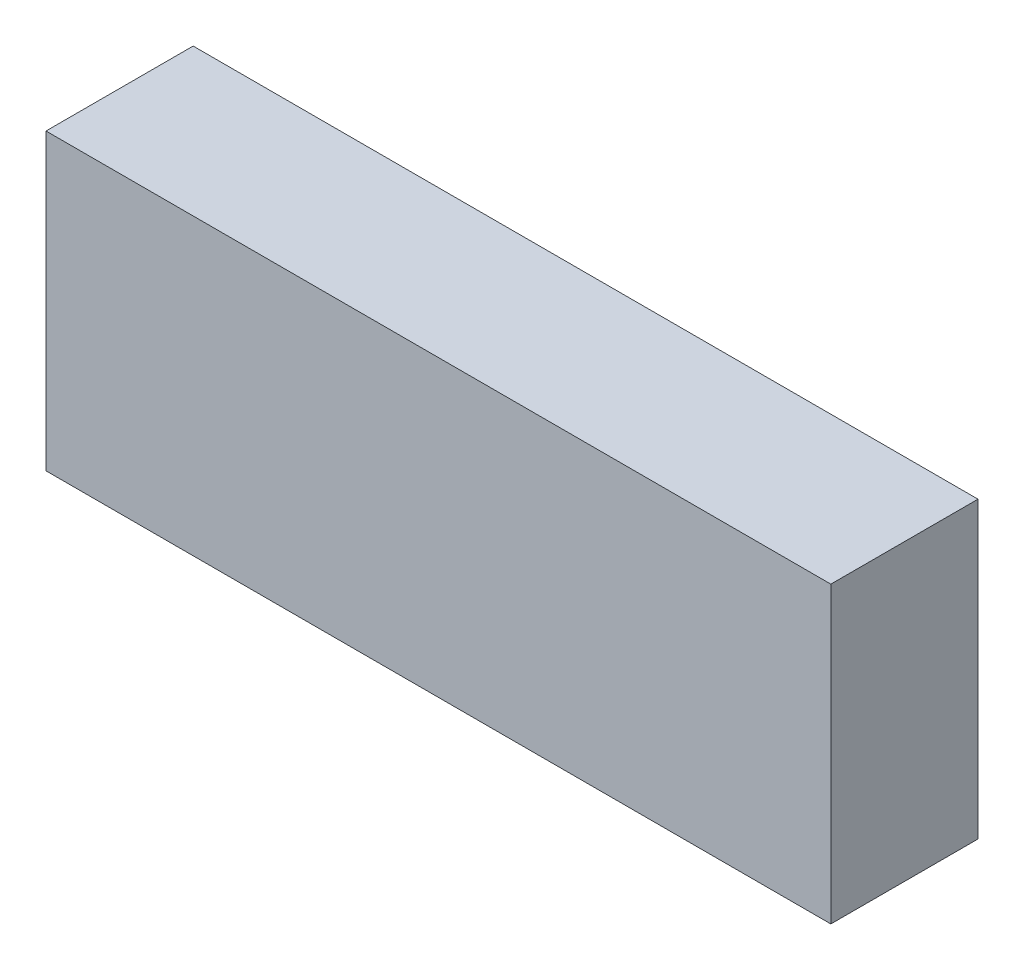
from build123d import *

# Parameters (mm, degrees)
SKETCH1_W           = 203.2
SKETCH1_H           = 38.1
BOSS_EXTRUDE1_DEPTH = 76.2


with BuildPart() as part:
    # Sketch1 → Boss-Extrude1 (new body)
    with BuildSketch(Plane(origin=(0, 0, 0), x_dir=(1, 0, 0), z_dir=(0, 1, 0))):
        Rectangle(SKETCH1_W, SKETCH1_H)
    extrude(amount=BOSS_EXTRUDE1_DEPTH)


solid = part.part
